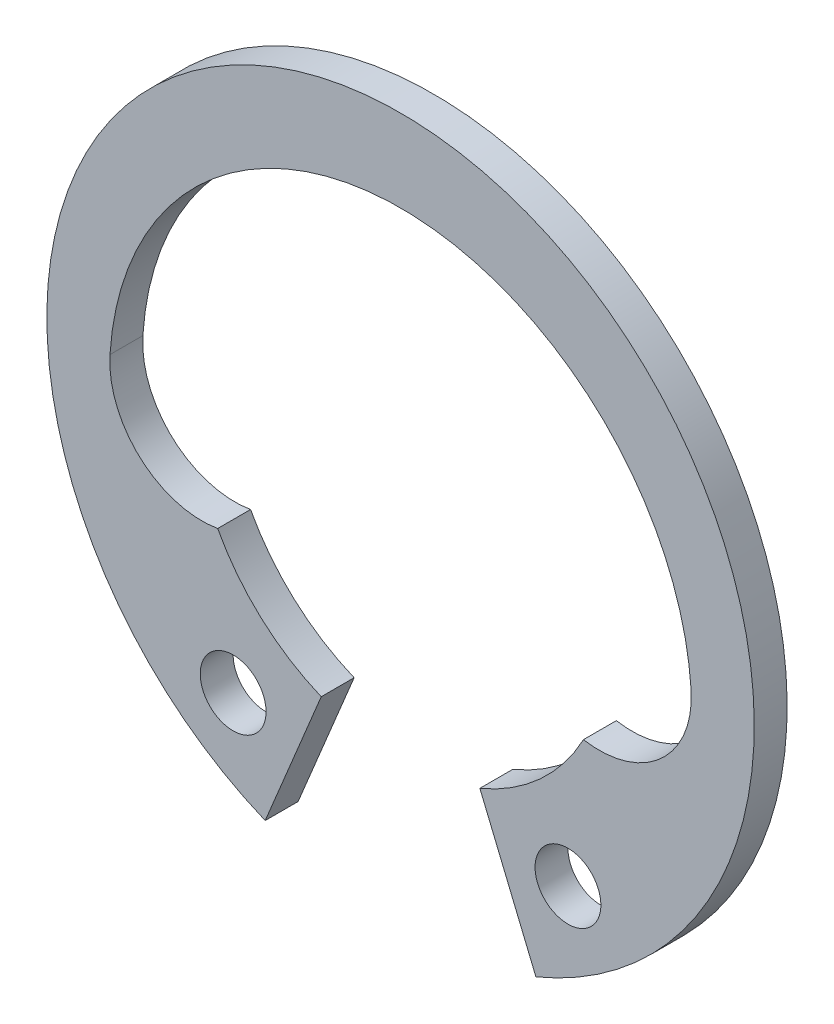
ISO-10303-21;
HEADER;
FILE_DESCRIPTION(('STEP AP214'),'2;1');
FILE_NAME('part.step','',(''),(''),'','','');
FILE_SCHEMA(('AUTOMOTIVE_DESIGN { 1 0 10303 214 1 1 1 1 }'));
ENDSEC;
DATA;
#1=APPLICATION_CONTEXT('core data for automotive mechanical design processes');
#2=APPLICATION_PROTOCOL_DEFINITION('international standard','automotive_design',2000,#1);
#3=PRODUCT_CONTEXT('',#1,'mechanical');
#4=PRODUCT('Part','Part','',(#3));
#5=PRODUCT_RELATED_PRODUCT_CATEGORY('part','',(#4));
#6=PRODUCT_DEFINITION_FORMATION('','',#4);
#7=PRODUCT_DEFINITION_CONTEXT('part definition',#1,'design');
#8=PRODUCT_DEFINITION('design','',#6,#7);
#9=PRODUCT_DEFINITION_SHAPE('','',#8);
#10=(LENGTH_UNIT() NAMED_UNIT(*) SI_UNIT(.MILLI.,.METRE.));
#11=(NAMED_UNIT(*) PLANE_ANGLE_UNIT() SI_UNIT($,.RADIAN.));
#12=(NAMED_UNIT(*) SI_UNIT($,.STERADIAN.) SOLID_ANGLE_UNIT());
#13=UNCERTAINTY_MEASURE_WITH_UNIT(LENGTH_MEASURE(1.E-05),#10,'distance_accuracy_value','');
#14=(GEOMETRIC_REPRESENTATION_CONTEXT(3) GLOBAL_UNCERTAINTY_ASSIGNED_CONTEXT((#13)) GLOBAL_UNIT_ASSIGNED_CONTEXT((#10,
#11,#12)) REPRESENTATION_CONTEXT('',''));
#15=CARTESIAN_POINT('',(0.,0.,0.));
#16=DIRECTION('',(0.,0.,1.));
#17=DIRECTION('',(1.,0.,0.));
#18=AXIS2_PLACEMENT_3D('',#15,#16,#17);
#19=CARTESIAN_POINT('',(0.,0.,-1.));
#20=DIRECTION('',(0.,0.,1.));
#21=DIRECTION('',(1.,0.,0.));
#22=AXIS2_PLACEMENT_3D('',#19,#20,#21);
#23=CYLINDRICAL_SURFACE('',#22,10.75);
#24=CARTESIAN_POINT('',(0.,0.,0.));
#25=DIRECTION('',(0.,0.,1.));
#26=DIRECTION('',(1.,0.,0.));
#27=AXIS2_PLACEMENT_3D('',#24,#25,#26);
#28=CIRCLE('',#27,10.75);
#29=CARTESIAN_POINT('',(4.11384689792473,-9.93170497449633,0.));
#30=VERTEX_POINT('',#29);
#31=CARTESIAN_POINT('',(-4.11384689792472,-9.93170497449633,0.));
#32=VERTEX_POINT('',#31);
#33=EDGE_CURVE('E130',#30,#32,#28,.T.);
#34=ORIENTED_EDGE('',*,*,#33,.F.);
#35=DIRECTION('',(0.,0.,1.));
#36=VECTOR('',#35,1.);
#37=CARTESIAN_POINT('',(4.11384689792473,-9.93170497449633,-1.));
#38=LINE('',#37,#36);
#39=CARTESIAN_POINT('',(4.11384689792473,-9.93170497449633,-1.));
#40=VERTEX_POINT('',#39);
#41=EDGE_CURVE('E11',#40,#30,#38,.T.);
#42=ORIENTED_EDGE('',*,*,#41,.F.);
#43=CARTESIAN_POINT('',(0.,0.,-1.));
#44=DIRECTION('',(0.,0.,1.));
#45=DIRECTION('',(1.,0.,0.));
#46=AXIS2_PLACEMENT_3D('',#43,#44,#45);
#47=CIRCLE('',#46,10.75);
#48=CARTESIAN_POINT('',(-4.11384689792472,-9.93170497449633,-1.));
#49=VERTEX_POINT('',#48);
#50=EDGE_CURVE('E151',#40,#49,#47,.T.);
#51=ORIENTED_EDGE('',*,*,#50,.T.);
#52=DIRECTION('',(0.,0.,1.));
#53=VECTOR('',#52,1.);
#54=CARTESIAN_POINT('',(-4.11384689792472,-9.93170497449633,-1.));
#55=LINE('',#54,#53);
#56=EDGE_CURVE('E36',#49,#32,#55,.T.);
#57=ORIENTED_EDGE('',*,*,#56,.T.);
#58=EDGE_LOOP('',(#34,#42,#51,#57));
#59=FACE_BOUND('',#58,.T.);
#60=ADVANCED_FACE('F33',(#59),#23,.T.);
#61=CARTESIAN_POINT('',(2.41090562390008,-5.8204410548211,-1.));
#62=DIRECTION('',(-0.923879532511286,-0.382683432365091,0.));
#63=DIRECTION('',(0.382683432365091,-0.923879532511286,0.));
#64=AXIS2_PLACEMENT_3D('',#61,#62,#63);
#65=PLANE('',#64);
#66=DIRECTION('',(0.382683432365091,-0.923879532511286,0.));
#67=VECTOR('',#66,1.);
#68=CARTESIAN_POINT('',(2.41090562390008,-5.8204410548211,0.));
#69=LINE('',#68,#67);
#70=CARTESIAN_POINT('',(2.41090562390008,-5.8204410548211,0.));
#71=VERTEX_POINT('',#70);
#72=EDGE_CURVE('E149',#71,#30,#69,.T.);
#73=ORIENTED_EDGE('',*,*,#72,.F.);
#74=DIRECTION('',(0.,0.,1.));
#75=VECTOR('',#74,1.);
#76=CARTESIAN_POINT('',(2.41090562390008,-5.8204410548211,-1.));
#77=LINE('',#76,#75);
#78=CARTESIAN_POINT('',(2.41090562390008,-5.8204410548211,-1.));
#79=VERTEX_POINT('',#78);
#80=EDGE_CURVE('E42',#79,#71,#77,.T.);
#81=ORIENTED_EDGE('',*,*,#80,.F.);
#82=DIRECTION('',(0.382683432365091,-0.923879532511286,0.));
#83=VECTOR('',#82,1.);
#84=CARTESIAN_POINT('',(2.41090562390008,-5.8204410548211,-1.));
#85=LINE('',#84,#83);
#86=EDGE_CURVE('E120',#79,#40,#85,.T.);
#87=ORIENTED_EDGE('',*,*,#86,.T.);
#88=ORIENTED_EDGE('',*,*,#41,.T.);
#89=EDGE_LOOP('',(#73,#81,#87,#88));
#90=FACE_BOUND('',#89,.T.);
#91=ADVANCED_FACE('F163',(#90),#65,.T.);
#92=CARTESIAN_POINT('',(0.,0.,-1.));
#93=DIRECTION('',(0.,0.,1.));
#94=DIRECTION('',(1.,0.,0.));
#95=AXIS2_PLACEMENT_3D('',#92,#93,#94);
#96=CYLINDRICAL_SURFACE('',#95,6.3);
#97=CARTESIAN_POINT('',(0.,0.,0.));
#98=DIRECTION('',(0.,0.,-1.));
#99=DIRECTION('',(-1.,0.,0.));
#100=AXIS2_PLACEMENT_3D('',#97,#98,#99);
#101=CIRCLE('',#100,6.3);
#102=CARTESIAN_POINT('',(5.55812924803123,-2.96600729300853,0.));
#103=VERTEX_POINT('',#102);
#104=EDGE_CURVE('E107',#103,#71,#101,.T.);
#105=ORIENTED_EDGE('',*,*,#104,.F.);
#106=DIRECTION('',(0.,0.,1.));
#107=VECTOR('',#106,1.);
#108=CARTESIAN_POINT('',(5.55812924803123,-2.96600729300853,-1.));
#109=LINE('',#108,#107);
#110=CARTESIAN_POINT('',(5.55812924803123,-2.96600729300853,-1.));
#111=VERTEX_POINT('',#110);
#112=EDGE_CURVE('E102',#111,#103,#109,.T.);
#113=ORIENTED_EDGE('',*,*,#112,.F.);
#114=CARTESIAN_POINT('',(0.,0.,-1.));
#115=DIRECTION('',(0.,0.,-1.));
#116=DIRECTION('',(-1.,0.,0.));
#117=AXIS2_PLACEMENT_3D('',#114,#115,#116);
#118=CIRCLE('',#117,6.3);
#119=EDGE_CURVE('E105',#111,#79,#118,.T.);
#120=ORIENTED_EDGE('',*,*,#119,.T.);
#121=ORIENTED_EDGE('',*,*,#80,.T.);
#122=EDGE_LOOP('',(#105,#113,#120,#121));
#123=FACE_BOUND('',#122,.T.);
#124=ADVANCED_FACE('F104',(#123),#96,.F.);
#125=CARTESIAN_POINT('',(6.03724182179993,-0.207302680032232,-1.));
#126=DIRECTION('',(0.,0.,1.));
#127=DIRECTION('',(1.,0.,0.));
#128=AXIS2_PLACEMENT_3D('',#125,#126,#127);
#129=CYLINDRICAL_SURFACE('',#128,2.8);
#130=CARTESIAN_POINT('',(6.03724182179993,-0.207302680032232,0.));
#131=DIRECTION('',(0.,0.,-1.));
#132=DIRECTION('',(-1.,0.,0.));
#133=AXIS2_PLACEMENT_3D('',#130,#131,#132);
#134=CIRCLE('',#133,2.8);
#135=CARTESIAN_POINT('',(8.83133721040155,-0.0255584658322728,0.));
#136=VERTEX_POINT('',#135);
#137=EDGE_CURVE('E146',#136,#103,#134,.T.);
#138=ORIENTED_EDGE('',*,*,#137,.F.);
#139=DIRECTION('',(0.,0.,1.));
#140=VECTOR('',#139,1.);
#141=CARTESIAN_POINT('',(8.83133721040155,-0.0255584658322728,-1.));
#142=LINE('',#141,#140);
#143=CARTESIAN_POINT('',(8.83133721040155,-0.0255584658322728,-1.));
#144=VERTEX_POINT('',#143);
#145=EDGE_CURVE('E112',#144,#136,#142,.T.);
#146=ORIENTED_EDGE('',*,*,#145,.F.);
#147=CARTESIAN_POINT('',(6.03724182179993,-0.207302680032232,-1.));
#148=DIRECTION('',(0.,0.,-1.));
#149=DIRECTION('',(-1.,0.,0.));
#150=AXIS2_PLACEMENT_3D('',#147,#148,#149);
#151=CIRCLE('',#150,2.8);
#152=EDGE_CURVE('E118',#144,#111,#151,.T.);
#153=ORIENTED_EDGE('',*,*,#152,.T.);
#154=ORIENTED_EDGE('',*,*,#112,.T.);
#155=EDGE_LOOP('',(#138,#146,#153,#154));
#156=FACE_BOUND('',#155,.T.);
#157=ADVANCED_FACE('F122',(#156),#129,.F.);
#158=CARTESIAN_POINT('',(0.,-0.6,-1.));
#159=DIRECTION('',(0.,0.,1.));
#160=DIRECTION('',(1.,0.,0.));
#161=AXIS2_PLACEMENT_3D('',#158,#159,#160);
#162=CYLINDRICAL_SURFACE('',#161,8.85);
#163=CARTESIAN_POINT('',(0.,-0.6,0.));
#164=DIRECTION('',(0.,0.,-1.));
#165=DIRECTION('',(1.,0.,0.));
#166=AXIS2_PLACEMENT_3D('',#163,#164,#165);
#167=CIRCLE('',#166,8.85);
#168=CARTESIAN_POINT('',(-8.83133721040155,-0.0255584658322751,0.));
#169=VERTEX_POINT('',#168);
#170=EDGE_CURVE('E143',#169,#136,#167,.T.);
#171=ORIENTED_EDGE('',*,*,#170,.F.);
#172=DIRECTION('',(0.,0.,1.));
#173=VECTOR('',#172,1.);
#174=CARTESIAN_POINT('',(-8.83133721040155,-0.0255584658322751,-1.));
#175=LINE('',#174,#173);
#176=CARTESIAN_POINT('',(-8.83133721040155,-0.0255584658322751,-1.));
#177=VERTEX_POINT('',#176);
#178=EDGE_CURVE('E155',#177,#169,#175,.T.);
#179=ORIENTED_EDGE('',*,*,#178,.F.);
#180=CARTESIAN_POINT('',(0.,-0.6,-1.));
#181=DIRECTION('',(0.,0.,-1.));
#182=DIRECTION('',(1.,0.,0.));
#183=AXIS2_PLACEMENT_3D('',#180,#181,#182);
#184=CIRCLE('',#183,8.85);
#185=EDGE_CURVE('E123',#177,#144,#184,.T.);
#186=ORIENTED_EDGE('',*,*,#185,.T.);
#187=ORIENTED_EDGE('',*,*,#145,.T.);
#188=EDGE_LOOP('',(#171,#179,#186,#187));
#189=FACE_BOUND('',#188,.T.);
#190=ADVANCED_FACE('F176',(#189),#162,.F.);
#191=CARTESIAN_POINT('',(-6.03724182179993,-0.207302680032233,-1.));
#192=DIRECTION('',(0.,0.,1.));
#193=DIRECTION('',(1.,0.,0.));
#194=AXIS2_PLACEMENT_3D('',#191,#192,#193);
#195=CYLINDRICAL_SURFACE('',#194,2.8);
#196=CARTESIAN_POINT('',(-6.03724182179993,-0.207302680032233,0.));
#197=DIRECTION('',(0.,0.,-1.));
#198=DIRECTION('',(1.,0.,0.));
#199=AXIS2_PLACEMENT_3D('',#196,#197,#198);
#200=CIRCLE('',#199,2.8);
#201=CARTESIAN_POINT('',(-5.55812924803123,-2.96600729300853,0.));
#202=VERTEX_POINT('',#201);
#203=EDGE_CURVE('E140',#202,#169,#200,.T.);
#204=ORIENTED_EDGE('',*,*,#203,.F.);
#205=DIRECTION('',(0.,0.,1.));
#206=VECTOR('',#205,1.);
#207=CARTESIAN_POINT('',(-5.55812924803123,-2.96600729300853,-1.));
#208=LINE('',#207,#206);
#209=CARTESIAN_POINT('',(-5.55812924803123,-2.96600729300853,-1.));
#210=VERTEX_POINT('',#209);
#211=EDGE_CURVE('E157',#210,#202,#208,.T.);
#212=ORIENTED_EDGE('',*,*,#211,.F.);
#213=CARTESIAN_POINT('',(-6.03724182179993,-0.207302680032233,-1.));
#214=DIRECTION('',(0.,0.,-1.));
#215=DIRECTION('',(1.,0.,0.));
#216=AXIS2_PLACEMENT_3D('',#213,#214,#215);
#217=CIRCLE('',#216,2.8);
#218=EDGE_CURVE('E125',#210,#177,#217,.T.);
#219=ORIENTED_EDGE('',*,*,#218,.T.);
#220=ORIENTED_EDGE('',*,*,#178,.T.);
#221=EDGE_LOOP('',(#204,#212,#219,#220));
#222=FACE_BOUND('',#221,.T.);
#223=ADVANCED_FACE('F179',(#222),#195,.F.);
#224=CARTESIAN_POINT('',(0.,0.,-1.));
#225=DIRECTION('',(0.,0.,1.));
#226=DIRECTION('',(1.,0.,0.));
#227=AXIS2_PLACEMENT_3D('',#224,#225,#226);
#228=CYLINDRICAL_SURFACE('',#227,6.3);
#229=CARTESIAN_POINT('',(0.,0.,0.));
#230=DIRECTION('',(0.,0.,-1.));
#231=DIRECTION('',(1.,0.,0.));
#232=AXIS2_PLACEMENT_3D('',#229,#230,#231);
#233=CIRCLE('',#232,6.3);
#234=CARTESIAN_POINT('',(-2.41090562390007,-5.8204410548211,0.));
#235=VERTEX_POINT('',#234);
#236=EDGE_CURVE('E137',#235,#202,#233,.T.);
#237=ORIENTED_EDGE('',*,*,#236,.F.);
#238=DIRECTION('',(0.,0.,1.));
#239=VECTOR('',#238,1.);
#240=CARTESIAN_POINT('',(-2.41090562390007,-5.8204410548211,-1.));
#241=LINE('',#240,#239);
#242=CARTESIAN_POINT('',(-2.41090562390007,-5.8204410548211,-1.));
#243=VERTEX_POINT('',#242);
#244=EDGE_CURVE('E158',#243,#235,#241,.T.);
#245=ORIENTED_EDGE('',*,*,#244,.F.);
#246=CARTESIAN_POINT('',(0.,0.,-1.));
#247=DIRECTION('',(0.,0.,-1.));
#248=DIRECTION('',(1.,0.,0.));
#249=AXIS2_PLACEMENT_3D('',#246,#247,#248);
#250=CIRCLE('',#249,6.3);
#251=EDGE_CURVE('E225',#243,#210,#250,.T.);
#252=ORIENTED_EDGE('',*,*,#251,.T.);
#253=ORIENTED_EDGE('',*,*,#211,.T.);
#254=EDGE_LOOP('',(#237,#245,#252,#253));
#255=FACE_BOUND('',#254,.T.);
#256=ADVANCED_FACE('F183',(#255),#228,.F.);
#257=CARTESIAN_POINT('',(-2.41090562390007,-5.8204410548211,-1.));
#258=DIRECTION('',(0.923879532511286,-0.38268343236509,0.));
#259=DIRECTION('',(0.382683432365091,0.923879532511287,0.));
#260=AXIS2_PLACEMENT_3D('',#257,#258,#259);
#261=PLANE('',#260);
#262=DIRECTION('',(0.38268343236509,0.923879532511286,0.));
#263=VECTOR('',#262,1.);
#264=CARTESIAN_POINT('',(-2.41090562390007,-5.8204410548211,0.));
#265=LINE('',#264,#263);
#266=EDGE_CURVE('E133',#32,#235,#265,.T.);
#267=ORIENTED_EDGE('',*,*,#266,.F.);
#268=ORIENTED_EDGE('',*,*,#56,.F.);
#269=DIRECTION('',(0.38268343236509,0.923879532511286,0.));
#270=VECTOR('',#269,1.);
#271=CARTESIAN_POINT('',(-2.41090562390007,-5.8204410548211,-1.));
#272=LINE('',#271,#270);
#273=EDGE_CURVE('E223',#49,#243,#272,.T.);
#274=ORIENTED_EDGE('',*,*,#273,.T.);
#275=ORIENTED_EDGE('',*,*,#244,.T.);
#276=EDGE_LOOP('',(#267,#268,#274,#275));
#277=FACE_BOUND('',#276,.T.);
#278=ADVANCED_FACE('F160',(#277),#261,.T.);
#279=CARTESIAN_POINT('',(0.,0.,-1.));
#280=DIRECTION('',(0.,0.,1.));
#281=DIRECTION('',(1.,0.,0.));
#282=AXIS2_PLACEMENT_3D('',#279,#280,#281);
#283=PLANE('',#282);
#284=CARTESIAN_POINT('',(5.0879376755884,-7.05711628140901,-1.));
#285=DIRECTION('',(0.,0.,1.));
#286=DIRECTION('',(-1.,0.,0.));
#287=AXIS2_PLACEMENT_3D('',#284,#285,#286);
#288=CIRCLE('',#287,1.);
#289=CARTESIAN_POINT('',(4.0879376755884,-7.05711628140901,-1.));
#290=VERTEX_POINT('',#289);
#291=EDGE_CURVE('E210',#290,#290,#288,.T.);
#292=ORIENTED_EDGE('',*,*,#291,.T.);
#293=EDGE_LOOP('',(#292));
#294=FACE_BOUND('',#293,.T.);
#295=CARTESIAN_POINT('',(-5.08793767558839,-7.05711628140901,-1.));
#296=DIRECTION('',(0.,0.,1.));
#297=DIRECTION('',(1.,0.,0.));
#298=AXIS2_PLACEMENT_3D('',#295,#296,#297);
#299=CIRCLE('',#298,1.);
#300=CARTESIAN_POINT('',(-4.08793767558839,-7.05711628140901,-1.));
#301=VERTEX_POINT('',#300);
#302=EDGE_CURVE('E134',#301,#301,#299,.T.);
#303=ORIENTED_EDGE('',*,*,#302,.T.);
#304=EDGE_LOOP('',(#303));
#305=FACE_BOUND('',#304,.T.);
#306=ORIENTED_EDGE('',*,*,#50,.F.);
#307=ORIENTED_EDGE('',*,*,#86,.F.);
#308=ORIENTED_EDGE('',*,*,#119,.F.);
#309=ORIENTED_EDGE('',*,*,#152,.F.);
#310=ORIENTED_EDGE('',*,*,#185,.F.);
#311=ORIENTED_EDGE('',*,*,#218,.F.);
#312=ORIENTED_EDGE('',*,*,#251,.F.);
#313=ORIENTED_EDGE('',*,*,#273,.F.);
#314=EDGE_LOOP('',(#306,#307,#308,#309,#310,#311,#312,#313));
#315=FACE_BOUND('',#314,.T.);
#316=ADVANCED_FACE('F116',(#294,#305,#315),#283,.F.);
#317=CARTESIAN_POINT('',(0.,0.,0.));
#318=DIRECTION('',(0.,0.,1.));
#319=DIRECTION('',(1.,0.,0.));
#320=AXIS2_PLACEMENT_3D('',#317,#318,#319);
#321=PLANE('',#320);
#322=CARTESIAN_POINT('',(5.0879376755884,-7.05711628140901,0.));
#323=DIRECTION('',(0.,0.,1.));
#324=DIRECTION('',(-1.,0.,0.));
#325=AXIS2_PLACEMENT_3D('',#322,#323,#324);
#326=CIRCLE('',#325,1.);
#327=CARTESIAN_POINT('',(4.0879376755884,-7.05711628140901,0.));
#328=VERTEX_POINT('',#327);
#329=EDGE_CURVE('E213',#328,#328,#326,.T.);
#330=ORIENTED_EDGE('',*,*,#329,.F.);
#331=EDGE_LOOP('',(#330));
#332=FACE_BOUND('',#331,.T.);
#333=CARTESIAN_POINT('',(-5.08793767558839,-7.05711628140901,0.));
#334=DIRECTION('',(0.,0.,1.));
#335=DIRECTION('',(1.,0.,0.));
#336=AXIS2_PLACEMENT_3D('',#333,#334,#335);
#337=CIRCLE('',#336,1.);
#338=CARTESIAN_POINT('',(-4.08793767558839,-7.05711628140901,0.));
#339=VERTEX_POINT('',#338);
#340=EDGE_CURVE('E215',#339,#339,#337,.T.);
#341=ORIENTED_EDGE('',*,*,#340,.F.);
#342=EDGE_LOOP('',(#341));
#343=FACE_BOUND('',#342,.T.);
#344=ORIENTED_EDGE('',*,*,#33,.T.);
#345=ORIENTED_EDGE('',*,*,#266,.T.);
#346=ORIENTED_EDGE('',*,*,#236,.T.);
#347=ORIENTED_EDGE('',*,*,#203,.T.);
#348=ORIENTED_EDGE('',*,*,#170,.T.);
#349=ORIENTED_EDGE('',*,*,#137,.T.);
#350=ORIENTED_EDGE('',*,*,#104,.T.);
#351=ORIENTED_EDGE('',*,*,#72,.T.);
#352=EDGE_LOOP('',(#344,#345,#346,#347,#348,#349,#350,#351));
#353=FACE_BOUND('',#352,.T.);
#354=ADVANCED_FACE('F162',(#332,#343,#353),#321,.T.);
#355=CARTESIAN_POINT('',(-5.08793767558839,-7.05711628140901,-1.));
#356=DIRECTION('',(0.,0.,1.));
#357=DIRECTION('',(1.,0.,0.));
#358=AXIS2_PLACEMENT_3D('',#355,#356,#357);
#359=CYLINDRICAL_SURFACE('',#358,1.);
#360=ORIENTED_EDGE('',*,*,#302,.F.);
#361=EDGE_LOOP('',(#360));
#362=FACE_BOUND('',#361,.T.);
#363=ORIENTED_EDGE('',*,*,#340,.T.);
#364=EDGE_LOOP('',(#363));
#365=FACE_BOUND('',#364,.T.);
#366=ADVANCED_FACE('F195',(#362,#365),#359,.F.);
#367=CARTESIAN_POINT('',(5.0879376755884,-7.05711628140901,-1.));
#368=DIRECTION('',(0.,0.,1.));
#369=DIRECTION('',(1.,0.,0.));
#370=AXIS2_PLACEMENT_3D('',#367,#368,#369);
#371=CYLINDRICAL_SURFACE('',#370,1.);
#372=ORIENTED_EDGE('',*,*,#291,.F.);
#373=EDGE_LOOP('',(#372));
#374=FACE_BOUND('',#373,.T.);
#375=ORIENTED_EDGE('',*,*,#329,.T.);
#376=EDGE_LOOP('',(#375));
#377=FACE_BOUND('',#376,.T.);
#378=ADVANCED_FACE('F202',(#374,#377),#371,.F.);
#379=CLOSED_SHELL('',(#60,#91,#124,#157,#190,#223,#256,#278,#316,#354,#366,#378));
#380=MANIFOLD_SOLID_BREP('B2',#379);
#381=ADVANCED_BREP_SHAPE_REPRESENTATION('',(#18,#380),#14);
#382=SHAPE_DEFINITION_REPRESENTATION(#9,#381);
ENDSEC;
END-ISO-10303-21;
